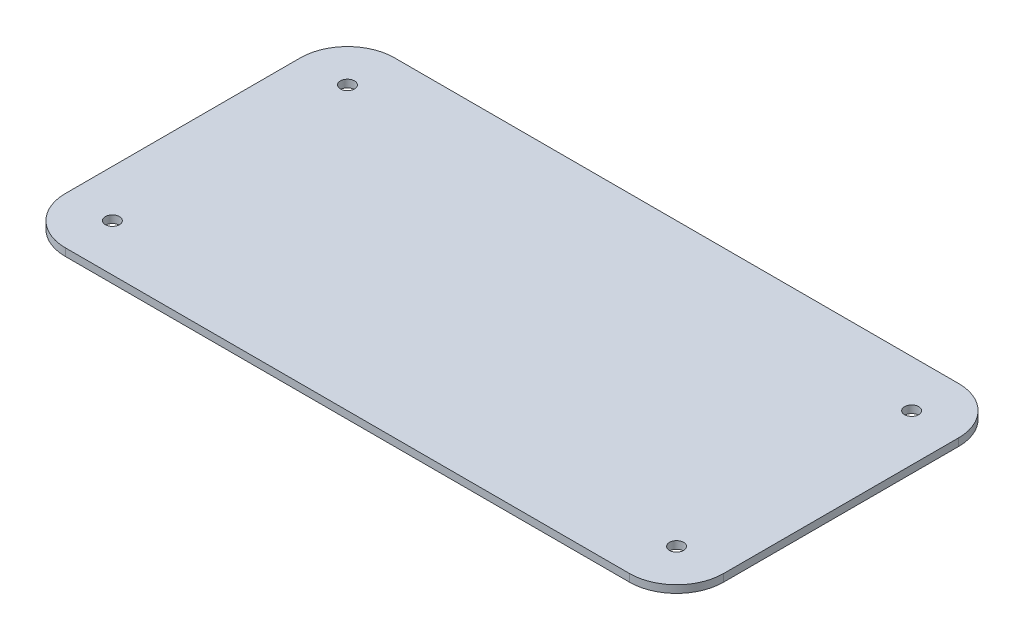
from build123d import *

# Parameters (mm, degrees)
BASE_EXTRUSION_DEPTH    = 8
ESQUISSE2_R             = 7.5
ENL_V_MAT_EXTRU_1_DEPTH = 8


with BuildPart() as part:
    # Esquisse1 → Base-Extrusion (new body)
    with BuildSketch(Plane(origin=(0, 0, 0), x_dir=(1, 0, 0), z_dir=(0, 1, 0))):
        with BuildLine():
            Line((50, 0), (650, 0))
            ThreePointArc((650, 0), (685.355339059, 14.644660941), (700, 50))
            Line((700, 50), (700, 300))
            ThreePointArc((700, 300), (685.355339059, 335.355339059), (650, 350))
            Line((650, 350), (50, 350))
            ThreePointArc((50, 350), (14.644660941, 335.355339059), (0, 300))
            Line((0, 300), (0, 50))
            ThreePointArc((0, 50), (14.644660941, 14.644660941), (50, 0))
        make_face()
    extrude(amount=BASE_EXTRUSION_DEPTH)

    # Esquisse2 → Enl_v. mat.-Extru.1 (cut)
    with BuildSketch(Plane(origin=(0, 8, 0), x_dir=(-1, 0, 0), z_dir=(0, 1, 0))):
        with Locations(Location((-50, -50, 0), (0, 0, 90))):
            Circle(ESQUISSE2_R)
        with Locations(Location((-50, -300, 0), (0, 0, 90))):
            Circle(ESQUISSE2_R)
        with Locations(Location((-650, -50, 0), (0, 0, 90))):
            Circle(ESQUISSE2_R)
        with Locations(Location((-650, -300, 0), (0, 0, 90))):
            Circle(ESQUISSE2_R)
    extrude(amount=-ENL_V_MAT_EXTRU_1_DEPTH, mode=Mode.SUBTRACT)


solid = part.part
